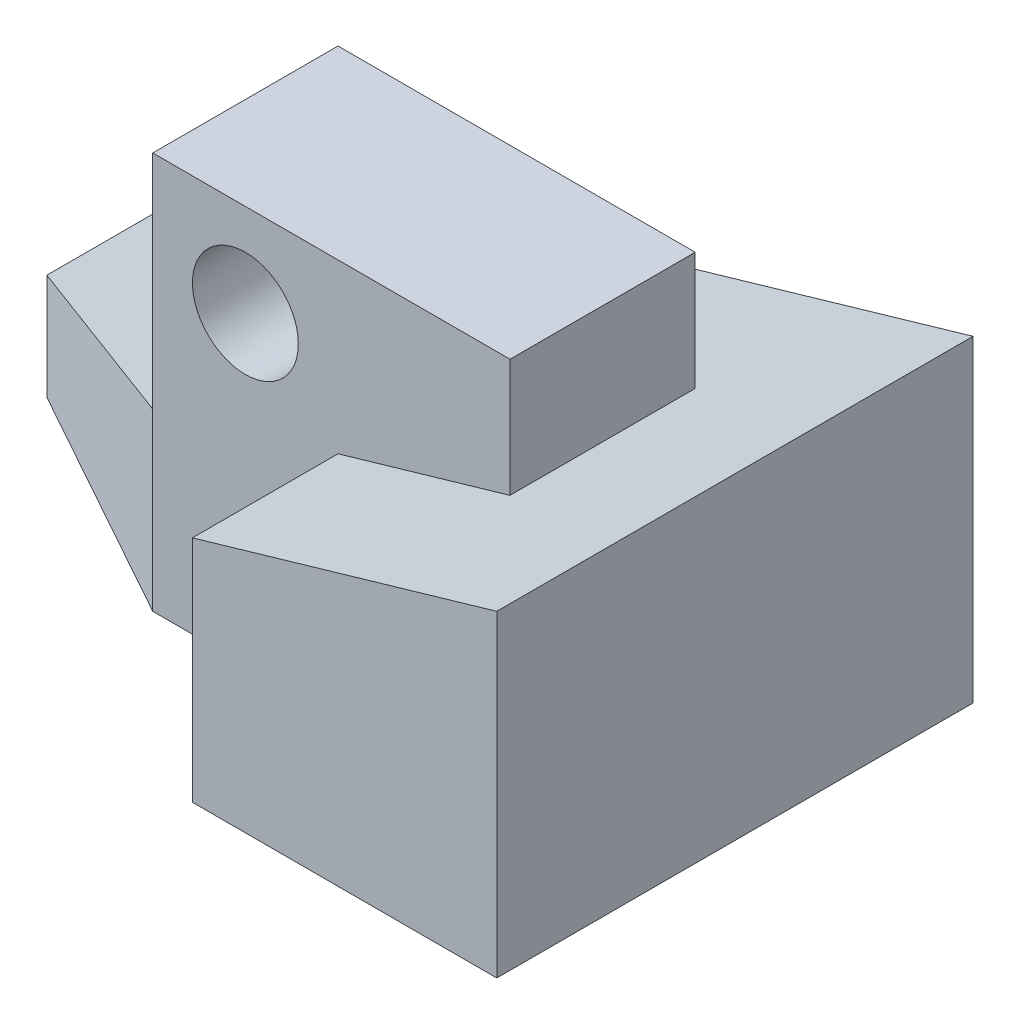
ISO-10303-21;
HEADER;
FILE_DESCRIPTION(('STEP AP214'),'2;1');
FILE_NAME('part.step','',(''),(''),'','','');
FILE_SCHEMA(('AUTOMOTIVE_DESIGN { 1 0 10303 214 1 1 1 1 }'));
ENDSEC;
DATA;
#1=APPLICATION_CONTEXT('core data for automotive mechanical design processes');
#2=APPLICATION_PROTOCOL_DEFINITION('international standard','automotive_design',2000,#1);
#3=PRODUCT_CONTEXT('',#1,'mechanical');
#4=PRODUCT('Part','Part','',(#3));
#5=PRODUCT_RELATED_PRODUCT_CATEGORY('part','',(#4));
#6=PRODUCT_DEFINITION_FORMATION('','',#4);
#7=PRODUCT_DEFINITION_CONTEXT('part definition',#1,'design');
#8=PRODUCT_DEFINITION('design','',#6,#7);
#9=PRODUCT_DEFINITION_SHAPE('','',#8);
#10=(LENGTH_UNIT() NAMED_UNIT(*) SI_UNIT(.MILLI.,.METRE.));
#11=(NAMED_UNIT(*) PLANE_ANGLE_UNIT() SI_UNIT($,.RADIAN.));
#12=(NAMED_UNIT(*) SI_UNIT($,.STERADIAN.) SOLID_ANGLE_UNIT());
#13=UNCERTAINTY_MEASURE_WITH_UNIT(LENGTH_MEASURE(1.E-05),#10,'distance_accuracy_value','');
#14=(GEOMETRIC_REPRESENTATION_CONTEXT(3) GLOBAL_UNCERTAINTY_ASSIGNED_CONTEXT((#13)) GLOBAL_UNIT_ASSIGNED_CONTEXT((#10,
#11,#12)) REPRESENTATION_CONTEXT('',''));
#15=CARTESIAN_POINT('',(0.,0.,0.));
#16=DIRECTION('',(0.,0.,1.));
#17=DIRECTION('',(1.,0.,0.));
#18=AXIS2_PLACEMENT_3D('',#15,#16,#17);
#19=CARTESIAN_POINT('',(0.,24.,15.));
#20=DIRECTION('',(1.,0.,0.));
#21=DIRECTION('',(0.,0.,-1.));
#22=AXIS2_PLACEMENT_3D('',#19,#20,#21);
#23=PLANE('',#22);
#24=DIRECTION('',(0.,-1.,0.));
#25=VECTOR('',#24,1.);
#26=CARTESIAN_POINT('',(0.,24.,15.));
#27=LINE('',#26,#25);
#28=CARTESIAN_POINT('',(0.,8.,15.));
#29=VERTEX_POINT('',#28);
#30=CARTESIAN_POINT('',(0.,0.,15.));
#31=VERTEX_POINT('',#30);
#32=EDGE_CURVE('E11',#29,#31,#27,.T.);
#33=ORIENTED_EDGE('',*,*,#32,.F.);
#34=DIRECTION('',(0.,0.,1.));
#35=VECTOR('',#34,1.);
#36=CARTESIAN_POINT('',(0.,8.,0.));
#37=LINE('',#36,#35);
#38=CARTESIAN_POINT('',(0.,8.,0.));
#39=VERTEX_POINT('',#38);
#40=EDGE_CURVE('E125',#39,#29,#37,.T.);
#41=ORIENTED_EDGE('',*,*,#40,.F.);
#42=DIRECTION('',(0.,-1.,0.));
#43=VECTOR('',#42,1.);
#44=CARTESIAN_POINT('',(0.,24.,0.));
#45=LINE('',#44,#43);
#46=CARTESIAN_POINT('',(0.,0.,0.));
#47=VERTEX_POINT('',#46);
#48=EDGE_CURVE('E95',#39,#47,#45,.T.);
#49=ORIENTED_EDGE('',*,*,#48,.T.);
#50=DIRECTION('',(0.,0.,1.));
#51=VECTOR('',#50,1.);
#52=CARTESIAN_POINT('',(0.,0.,15.));
#53=LINE('',#52,#51);
#54=EDGE_CURVE('E100',#47,#31,#53,.T.);
#55=ORIENTED_EDGE('',*,*,#54,.T.);
#56=EDGE_LOOP('',(#33,#41,#49,#55));
#57=FACE_BOUND('',#56,.T.);
#58=ADVANCED_FACE('F31',(#57),#23,.F.);
#59=CARTESIAN_POINT('',(18.,24.,25.));
#60=DIRECTION('',(0.485642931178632,0.,-0.874157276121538));
#61=DIRECTION('',(-0.874157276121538,0.,-0.485642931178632));
#62=AXIS2_PLACEMENT_3D('',#59,#60,#61);
#63=PLANE('',#62);
#64=DIRECTION('',(0.,-1.,0.));
#65=VECTOR('',#64,1.);
#66=CARTESIAN_POINT('',(18.,24.,25.));
#67=LINE('',#66,#65);
#68=CARTESIAN_POINT('',(18.,13.2363636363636,25.));
#69=VERTEX_POINT('',#68);
#70=CARTESIAN_POINT('',(18.,0.,25.));
#71=VERTEX_POINT('',#70);
#72=EDGE_CURVE('E40',#69,#71,#67,.T.);
#73=ORIENTED_EDGE('',*,*,#72,.F.);
#74=DIRECTION('',(-0.847192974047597,-0.246456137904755,-0.470662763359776));
#75=VECTOR('',#74,1.);
#76=CARTESIAN_POINT('',(20.2474032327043,13.8901536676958,26.2485573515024));
#77=LINE('',#76,#75);
#78=EDGE_CURVE('E129',#69,#29,#77,.T.);
#79=ORIENTED_EDGE('',*,*,#78,.T.);
#80=ORIENTED_EDGE('',*,*,#32,.T.);
#81=DIRECTION('',(0.874157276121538,0.,0.485642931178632));
#82=VECTOR('',#81,1.);
#83=CARTESIAN_POINT('',(18.,0.,25.));
#84=LINE('',#83,#82);
#85=EDGE_CURVE('E133',#31,#71,#84,.T.);
#86=ORIENTED_EDGE('',*,*,#85,.T.);
#87=EDGE_LOOP('',(#73,#79,#80,#86));
#88=FACE_BOUND('',#87,.T.);
#89=ADVANCED_FACE('F163',(#88),#63,.F.);
#90=CARTESIAN_POINT('',(32.,24.,25.));
#91=DIRECTION('',(0.,0.,-1.));
#92=DIRECTION('',(-1.,0.,0.));
#93=AXIS2_PLACEMENT_3D('',#90,#91,#92);
#94=PLANE('',#93);
#95=CARTESIAN_POINT('',(25.,23.,25.));
#96=DIRECTION('',(0.,0.,1.));
#97=DIRECTION('',(1.,0.,0.));
#98=AXIS2_PLACEMENT_3D('',#95,#96,#97);
#99=CIRCLE('',#98,4.);
#100=CARTESIAN_POINT('',(29.,23.,25.));
#101=VERTEX_POINT('',#100);
#102=EDGE_CURVE('E229',#101,#101,#99,.T.);
#103=ORIENTED_EDGE('',*,*,#102,.F.);
#104=EDGE_LOOP('',(#103));
#105=FACE_BOUND('',#104,.T.);
#106=DIRECTION('',(0.,-1.,0.));
#107=VECTOR('',#106,1.);
#108=CARTESIAN_POINT('',(32.,24.,25.));
#109=LINE('',#108,#107);
#110=CARTESIAN_POINT('',(32.,17.3090909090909,25.));
#111=VERTEX_POINT('',#110);
#112=CARTESIAN_POINT('',(32.,0.,25.));
#113=VERTEX_POINT('',#112);
#114=EDGE_CURVE('E110',#111,#113,#109,.T.);
#115=ORIENTED_EDGE('',*,*,#114,.F.);
#116=DIRECTION('',(-0.960195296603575,-0.279329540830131,0.));
#117=VECTOR('',#116,1.);
#118=CARTESIAN_POINT('',(33.7945748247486,17.8311490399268,25.));
#119=LINE('',#118,#117);
#120=CARTESIAN_POINT('',(44.9999999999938,21.0909090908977,25.));
#121=VERTEX_POINT('',#120);
#122=EDGE_CURVE('E117',#121,#111,#119,.T.);
#123=ORIENTED_EDGE('',*,*,#122,.F.);
#124=DIRECTION('',(0.,1.,0.));
#125=VECTOR('',#124,1.);
#126=CARTESIAN_POINT('',(45.,-500000.,25.));
#127=LINE('',#126,#125);
#128=CARTESIAN_POINT('',(45.,30.,25.));
#129=VERTEX_POINT('',#128);
#130=EDGE_CURVE('E196',#121,#129,#127,.T.);
#131=ORIENTED_EDGE('',*,*,#130,.T.);
#132=DIRECTION('',(-1.,0.,0.));
#133=VECTOR('',#132,1.);
#134=CARTESIAN_POINT('',(18.,30.,25.));
#135=LINE('',#134,#133);
#136=CARTESIAN_POINT('',(18.,30.,25.));
#137=VERTEX_POINT('',#136);
#138=EDGE_CURVE('E205',#129,#137,#135,.T.);
#139=ORIENTED_EDGE('',*,*,#138,.T.);
#140=DIRECTION('',(0.,1.,0.));
#141=VECTOR('',#140,1.);
#142=CARTESIAN_POINT('',(18.,-500000.,25.));
#143=LINE('',#142,#141);
#144=EDGE_CURVE('E160',#69,#137,#143,.T.);
#145=ORIENTED_EDGE('',*,*,#144,.F.);
#146=ORIENTED_EDGE('',*,*,#72,.T.);
#147=DIRECTION('',(1.,0.,0.));
#148=VECTOR('',#147,1.);
#149=CARTESIAN_POINT('',(32.,0.,25.));
#150=LINE('',#149,#148);
#151=EDGE_CURVE('E136',#71,#113,#150,.T.);
#152=ORIENTED_EDGE('',*,*,#151,.T.);
#153=EDGE_LOOP('',(#115,#123,#131,#139,#145,#146,#152));
#154=FACE_BOUND('',#153,.T.);
#155=ADVANCED_FACE('F155',(#105,#154),#94,.F.);
#156=CARTESIAN_POINT('',(32.,24.,36.));
#157=DIRECTION('',(1.,0.,0.));
#158=DIRECTION('',(0.,0.,-1.));
#159=AXIS2_PLACEMENT_3D('',#156,#157,#158);
#160=PLANE('',#159);
#161=DIRECTION('',(0.,-1.,0.));
#162=VECTOR('',#161,1.);
#163=CARTESIAN_POINT('',(32.,24.,36.));
#164=LINE('',#163,#162);
#165=CARTESIAN_POINT('',(32.,17.3090909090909,36.));
#166=VERTEX_POINT('',#165);
#167=CARTESIAN_POINT('',(32.,0.,36.));
#168=VERTEX_POINT('',#167);
#169=EDGE_CURVE('E108',#166,#168,#164,.T.);
#170=ORIENTED_EDGE('',*,*,#169,.F.);
#171=DIRECTION('',(0.,0.,-1.));
#172=VECTOR('',#171,1.);
#173=CARTESIAN_POINT('',(32.,17.3090909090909,36.));
#174=LINE('',#173,#172);
#175=EDGE_CURVE('E114',#166,#111,#174,.T.);
#176=ORIENTED_EDGE('',*,*,#175,.T.);
#177=ORIENTED_EDGE('',*,*,#114,.T.);
#178=DIRECTION('',(0.,0.,1.));
#179=VECTOR('',#178,1.);
#180=CARTESIAN_POINT('',(32.,0.,36.));
#181=LINE('',#180,#179);
#182=EDGE_CURVE('E139',#113,#168,#181,.T.);
#183=ORIENTED_EDGE('',*,*,#182,.T.);
#184=EDGE_LOOP('',(#170,#176,#177,#183));
#185=FACE_BOUND('',#184,.T.);
#186=ADVANCED_FACE('F147',(#185),#160,.F.);
#187=CARTESIAN_POINT('',(55.,24.,36.));
#188=DIRECTION('',(0.,0.,-1.));
#189=DIRECTION('',(-1.,0.,0.));
#190=AXIS2_PLACEMENT_3D('',#187,#188,#189);
#191=PLANE('',#190);
#192=DIRECTION('',(0.,-1.,0.));
#193=VECTOR('',#192,1.);
#194=CARTESIAN_POINT('',(55.,24.,36.));
#195=LINE('',#194,#193);
#196=CARTESIAN_POINT('',(55.,24.,36.));
#197=VERTEX_POINT('',#196);
#198=CARTESIAN_POINT('',(55.,0.,36.));
#199=VERTEX_POINT('',#198);
#200=EDGE_CURVE('E80',#197,#199,#195,.T.);
#201=ORIENTED_EDGE('',*,*,#200,.F.);
#202=DIRECTION('',(0.960195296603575,0.279329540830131,0.));
#203=VECTOR('',#202,1.);
#204=CARTESIAN_POINT('',(55.,24.,36.));
#205=LINE('',#204,#203);
#206=EDGE_CURVE('E48',#166,#197,#205,.T.);
#207=ORIENTED_EDGE('',*,*,#206,.F.);
#208=ORIENTED_EDGE('',*,*,#169,.T.);
#209=DIRECTION('',(1.,0.,0.));
#210=VECTOR('',#209,1.);
#211=CARTESIAN_POINT('',(55.,0.,36.));
#212=LINE('',#211,#210);
#213=EDGE_CURVE('E85',#168,#199,#212,.T.);
#214=ORIENTED_EDGE('',*,*,#213,.T.);
#215=EDGE_LOOP('',(#201,#207,#208,#214));
#216=FACE_BOUND('',#215,.T.);
#217=ADVANCED_FACE('F142',(#216),#191,.F.);
#218=CARTESIAN_POINT('',(55.,24.,0.));
#219=DIRECTION('',(-1.,0.,0.));
#220=DIRECTION('',(0.,0.,1.));
#221=AXIS2_PLACEMENT_3D('',#218,#219,#220);
#222=PLANE('',#221);
#223=DIRECTION('',(0.,0.,-1.));
#224=VECTOR('',#223,1.);
#225=CARTESIAN_POINT('',(55.,0.,0.));
#226=LINE('',#225,#224);
#227=CARTESIAN_POINT('',(55.,0.,0.));
#228=VERTEX_POINT('',#227);
#229=EDGE_CURVE('E74',#199,#228,#226,.T.);
#230=ORIENTED_EDGE('',*,*,#229,.T.);
#231=DIRECTION('',(0.,-1.,0.));
#232=VECTOR('',#231,1.);
#233=CARTESIAN_POINT('',(55.,24.,0.));
#234=LINE('',#233,#232);
#235=CARTESIAN_POINT('',(55.,24.,0.));
#236=VERTEX_POINT('',#235);
#237=EDGE_CURVE('E79',#236,#228,#234,.T.);
#238=ORIENTED_EDGE('',*,*,#237,.F.);
#239=DIRECTION('',(0.,0.,-1.));
#240=VECTOR('',#239,1.);
#241=CARTESIAN_POINT('',(55.,24.,0.));
#242=LINE('',#241,#240);
#243=EDGE_CURVE('E101',#197,#236,#242,.T.);
#244=ORIENTED_EDGE('',*,*,#243,.F.);
#245=ORIENTED_EDGE('',*,*,#200,.T.);
#246=EDGE_LOOP('',(#230,#238,#244,#245));
#247=FACE_BOUND('',#246,.T.);
#248=ADVANCED_FACE('F76',(#247),#222,.F.);
#249=CARTESIAN_POINT('',(0.,24.,0.));
#250=DIRECTION('',(0.,0.,1.));
#251=DIRECTION('',(1.,0.,0.));
#252=AXIS2_PLACEMENT_3D('',#249,#250,#251);
#253=PLANE('',#252);
#254=ORIENTED_EDGE('',*,*,#48,.F.);
#255=DIRECTION('',(0.960195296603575,0.279329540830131,0.));
#256=VECTOR('',#255,1.);
#257=CARTESIAN_POINT('',(55.,24.,0.));
#258=LINE('',#257,#256);
#259=EDGE_CURVE('E94',#39,#236,#258,.T.);
#260=ORIENTED_EDGE('',*,*,#259,.T.);
#261=ORIENTED_EDGE('',*,*,#237,.T.);
#262=DIRECTION('',(-1.,0.,0.));
#263=VECTOR('',#262,1.);
#264=CARTESIAN_POINT('',(0.,0.,0.));
#265=LINE('',#264,#263);
#266=EDGE_CURVE('E84',#228,#47,#265,.T.);
#267=ORIENTED_EDGE('',*,*,#266,.T.);
#268=EDGE_LOOP('',(#254,#260,#261,#267));
#269=FACE_BOUND('',#268,.T.);
#270=ADVANCED_FACE('F91',(#269),#253,.F.);
#271=CARTESIAN_POINT('',(0.,0.,0.));
#272=DIRECTION('',(0.,-1.,0.));
#273=DIRECTION('',(0.,0.,-1.));
#274=AXIS2_PLACEMENT_3D('',#271,#272,#273);
#275=PLANE('',#274);
#276=ORIENTED_EDGE('',*,*,#54,.F.);
#277=ORIENTED_EDGE('',*,*,#266,.F.);
#278=ORIENTED_EDGE('',*,*,#229,.F.);
#279=ORIENTED_EDGE('',*,*,#213,.F.);
#280=ORIENTED_EDGE('',*,*,#182,.F.);
#281=ORIENTED_EDGE('',*,*,#151,.F.);
#282=ORIENTED_EDGE('',*,*,#85,.F.);
#283=EDGE_LOOP('',(#276,#277,#278,#279,#280,#281,#282));
#284=FACE_BOUND('',#283,.T.);
#285=ADVANCED_FACE('F97',(#284),#275,.T.);
#286=CARTESIAN_POINT('',(55.,24.,0.));
#287=DIRECTION('',(0.279329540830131,-0.960195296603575,0.));
#288=DIRECTION('',(0.960195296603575,0.279329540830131,0.));
#289=AXIS2_PLACEMENT_3D('',#286,#287,#288);
#290=PLANE('',#289);
#291=ORIENTED_EDGE('',*,*,#78,.F.);
#292=DIRECTION('',(0.,0.,-1.));
#293=VECTOR('',#292,1.);
#294=CARTESIAN_POINT('',(18.,13.2363636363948,25.));
#295=LINE('',#294,#293);
#296=CARTESIAN_POINT('',(18.0000000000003,13.2363636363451,11.));
#297=VERTEX_POINT('',#296);
#298=EDGE_CURVE('E122',#69,#297,#295,.T.);
#299=ORIENTED_EDGE('',*,*,#298,.T.);
#300=DIRECTION('',(0.960195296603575,0.279329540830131,0.));
#301=VECTOR('',#300,1.);
#302=CARTESIAN_POINT('',(-134091.005790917,-39000.2925937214,11.));
#303=LINE('',#302,#301);
#304=CARTESIAN_POINT('',(45.,21.0909090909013,11.));
#305=VERTEX_POINT('',#304);
#306=EDGE_CURVE('E183',#297,#305,#303,.T.);
#307=ORIENTED_EDGE('',*,*,#306,.T.);
#308=DIRECTION('',(0.,0.,1.));
#309=VECTOR('',#308,1.);
#310=CARTESIAN_POINT('',(45.,21.0909090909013,25.));
#311=LINE('',#310,#309);
#312=EDGE_CURVE('E121',#305,#121,#311,.T.);
#313=ORIENTED_EDGE('',*,*,#312,.T.);
#314=ORIENTED_EDGE('',*,*,#122,.T.);
#315=ORIENTED_EDGE('',*,*,#175,.F.);
#316=ORIENTED_EDGE('',*,*,#206,.T.);
#317=ORIENTED_EDGE('',*,*,#243,.T.);
#318=ORIENTED_EDGE('',*,*,#259,.F.);
#319=ORIENTED_EDGE('',*,*,#40,.T.);
#320=EDGE_LOOP('',(#291,#299,#307,#313,#314,#315,#316,#317,#318,#319));
#321=FACE_BOUND('',#320,.T.);
#322=ADVANCED_FACE('F176',(#321),#290,.F.);
#323=CARTESIAN_POINT('',(18.,-500000.,25.));
#324=DIRECTION('',(1.,0.,0.));
#325=DIRECTION('',(0.,0.,-1.));
#326=AXIS2_PLACEMENT_3D('',#323,#324,#325);
#327=PLANE('',#326);
#328=ORIENTED_EDGE('',*,*,#298,.F.);
#329=ORIENTED_EDGE('',*,*,#144,.T.);
#330=DIRECTION('',(0.,0.,-1.));
#331=VECTOR('',#330,1.);
#332=CARTESIAN_POINT('',(18.,30.,25.));
#333=LINE('',#332,#331);
#334=CARTESIAN_POINT('',(18.,30.,11.));
#335=VERTEX_POINT('',#334);
#336=EDGE_CURVE('E222',#137,#335,#333,.T.);
#337=ORIENTED_EDGE('',*,*,#336,.T.);
#338=DIRECTION('',(0.,1.,0.));
#339=VECTOR('',#338,1.);
#340=CARTESIAN_POINT('',(18.,-500000.,11.));
#341=LINE('',#340,#339);
#342=EDGE_CURVE('E188',#297,#335,#341,.T.);
#343=ORIENTED_EDGE('',*,*,#342,.F.);
#344=EDGE_LOOP('',(#328,#329,#337,#343));
#345=FACE_BOUND('',#344,.T.);
#346=ADVANCED_FACE('F240',(#345),#327,.F.);
#347=CARTESIAN_POINT('',(18.,-500000.,11.));
#348=DIRECTION('',(0.,0.,1.));
#349=DIRECTION('',(1.,0.,0.));
#350=AXIS2_PLACEMENT_3D('',#347,#348,#349);
#351=PLANE('',#350);
#352=CARTESIAN_POINT('',(25.,23.,11.));
#353=DIRECTION('',(0.,0.,1.));
#354=DIRECTION('',(1.,0.,0.));
#355=AXIS2_PLACEMENT_3D('',#352,#353,#354);
#356=CIRCLE('',#355,4.);
#357=CARTESIAN_POINT('',(29.,23.,11.));
#358=VERTEX_POINT('',#357);
#359=EDGE_CURVE('E34',#358,#358,#356,.T.);
#360=ORIENTED_EDGE('',*,*,#359,.T.);
#361=EDGE_LOOP('',(#360));
#362=FACE_BOUND('',#361,.T.);
#363=ORIENTED_EDGE('',*,*,#306,.F.);
#364=ORIENTED_EDGE('',*,*,#342,.T.);
#365=DIRECTION('',(1.,0.,0.));
#366=VECTOR('',#365,1.);
#367=CARTESIAN_POINT('',(18.,30.,11.));
#368=LINE('',#367,#366);
#369=CARTESIAN_POINT('',(45.,30.,11.));
#370=VERTEX_POINT('',#369);
#371=EDGE_CURVE('E215',#335,#370,#368,.T.);
#372=ORIENTED_EDGE('',*,*,#371,.T.);
#373=DIRECTION('',(0.,1.,0.));
#374=VECTOR('',#373,1.);
#375=CARTESIAN_POINT('',(45.,-500000.,11.));
#376=LINE('',#375,#374);
#377=EDGE_CURVE('E190',#305,#370,#376,.T.);
#378=ORIENTED_EDGE('',*,*,#377,.F.);
#379=EDGE_LOOP('',(#363,#364,#372,#378));
#380=FACE_BOUND('',#379,.T.);
#381=ADVANCED_FACE('F214',(#362,#380),#351,.F.);
#382=CARTESIAN_POINT('',(45.,-500000.,25.));
#383=DIRECTION('',(-1.,0.,0.));
#384=DIRECTION('',(0.,0.,1.));
#385=AXIS2_PLACEMENT_3D('',#382,#383,#384);
#386=PLANE('',#385);
#387=ORIENTED_EDGE('',*,*,#312,.F.);
#388=ORIENTED_EDGE('',*,*,#377,.T.);
#389=DIRECTION('',(0.,0.,1.));
#390=VECTOR('',#389,1.);
#391=CARTESIAN_POINT('',(45.,30.,25.));
#392=LINE('',#391,#390);
#393=EDGE_CURVE('E199',#370,#129,#392,.T.);
#394=ORIENTED_EDGE('',*,*,#393,.T.);
#395=ORIENTED_EDGE('',*,*,#130,.F.);
#396=EDGE_LOOP('',(#387,#388,#394,#395));
#397=FACE_BOUND('',#396,.T.);
#398=ADVANCED_FACE('F210',(#397),#386,.F.);
#399=CARTESIAN_POINT('',(18.,30.,11.));
#400=DIRECTION('',(0.,-1.,0.));
#401=DIRECTION('',(0.,0.,-1.));
#402=AXIS2_PLACEMENT_3D('',#399,#400,#401);
#403=PLANE('',#402);
#404=ORIENTED_EDGE('',*,*,#336,.F.);
#405=ORIENTED_EDGE('',*,*,#138,.F.);
#406=ORIENTED_EDGE('',*,*,#393,.F.);
#407=ORIENTED_EDGE('',*,*,#371,.F.);
#408=EDGE_LOOP('',(#404,#405,#406,#407));
#409=FACE_BOUND('',#408,.T.);
#410=ADVANCED_FACE('F225',(#409),#403,.F.);
#411=CARTESIAN_POINT('',(25.,23.,0.));
#412=DIRECTION('',(0.,0.,1.));
#413=DIRECTION('',(1.,0.,0.));
#414=AXIS2_PLACEMENT_3D('',#411,#412,#413);
#415=CYLINDRICAL_SURFACE('',#414,4.);
#416=ORIENTED_EDGE('',*,*,#102,.T.);
#417=EDGE_LOOP('',(#416));
#418=FACE_BOUND('',#417,.T.);
#419=ORIENTED_EDGE('',*,*,#359,.F.);
#420=EDGE_LOOP('',(#419));
#421=FACE_BOUND('',#420,.T.);
#422=ADVANCED_FACE('F237',(#418,#421),#415,.F.);
#423=CLOSED_SHELL('',(#58,#89,#155,#186,#217,#248,#270,#285,#322,#346,#381,#398,#410,#422));
#424=MANIFOLD_SOLID_BREP('B2',#423);
#425=ADVANCED_BREP_SHAPE_REPRESENTATION('',(#18,#424),#14);
#426=SHAPE_DEFINITION_REPRESENTATION(#9,#425);
ENDSEC;
END-ISO-10303-21;
